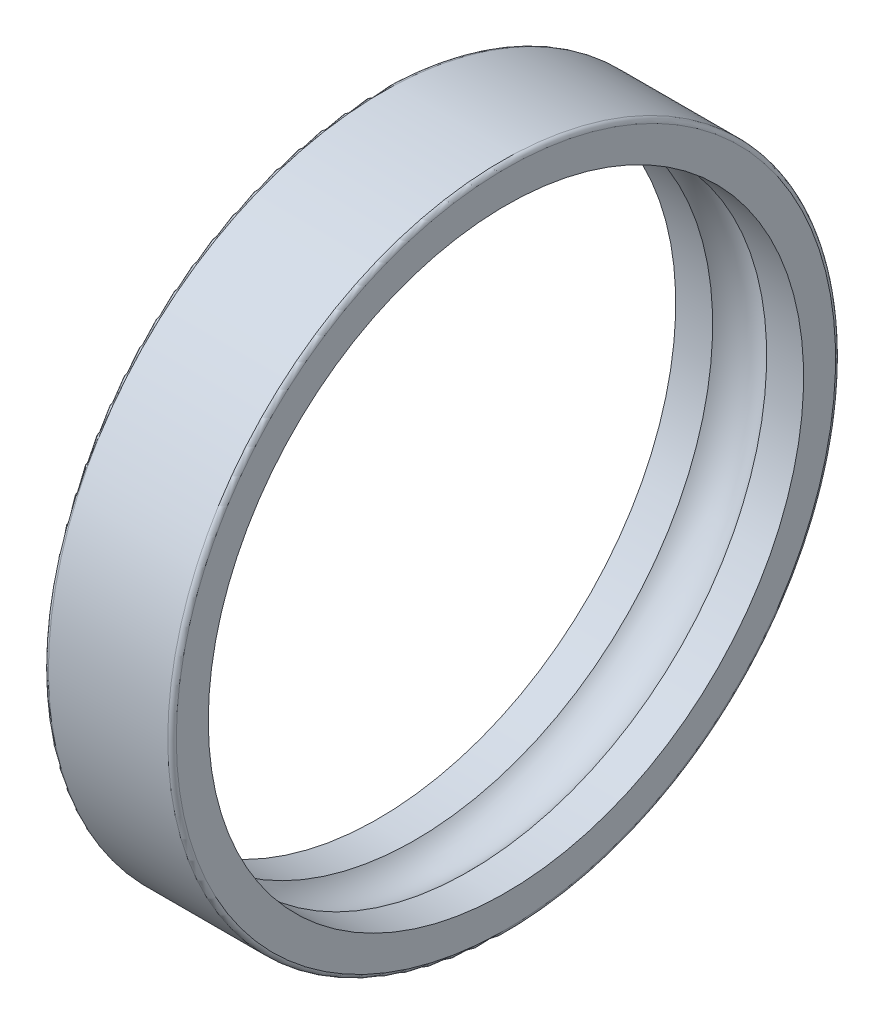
ISO-10303-21;
HEADER;
FILE_DESCRIPTION(('STEP AP214'),'2;1');
FILE_NAME('part.step','',(''),(''),'','','');
FILE_SCHEMA(('AUTOMOTIVE_DESIGN { 1 0 10303 214 1 1 1 1 }'));
ENDSEC;
DATA;
#1=APPLICATION_CONTEXT('core data for automotive mechanical design processes');
#2=APPLICATION_PROTOCOL_DEFINITION('international standard','automotive_design',2000,#1);
#3=PRODUCT_CONTEXT('',#1,'mechanical');
#4=PRODUCT('Part','Part','',(#3));
#5=PRODUCT_RELATED_PRODUCT_CATEGORY('part','',(#4));
#6=PRODUCT_DEFINITION_FORMATION('','',#4);
#7=PRODUCT_DEFINITION_CONTEXT('part definition',#1,'design');
#8=PRODUCT_DEFINITION('design','',#6,#7);
#9=PRODUCT_DEFINITION_SHAPE('','',#8);
#10=(LENGTH_UNIT() NAMED_UNIT(*) SI_UNIT(.MILLI.,.METRE.));
#11=(NAMED_UNIT(*) PLANE_ANGLE_UNIT() SI_UNIT($,.RADIAN.));
#12=(NAMED_UNIT(*) SI_UNIT($,.STERADIAN.) SOLID_ANGLE_UNIT());
#13=UNCERTAINTY_MEASURE_WITH_UNIT(LENGTH_MEASURE(1.E-05),#10,'distance_accuracy_value','');
#14=(GEOMETRIC_REPRESENTATION_CONTEXT(3) GLOBAL_UNCERTAINTY_ASSIGNED_CONTEXT((#13)) GLOBAL_UNIT_ASSIGNED_CONTEXT((#10,
#11,#12)) REPRESENTATION_CONTEXT('',''));
#15=CARTESIAN_POINT('',(0.,0.,0.));
#16=DIRECTION('',(0.,0.,1.));
#17=DIRECTION('',(1.,0.,0.));
#18=AXIS2_PLACEMENT_3D('',#15,#16,#17);
#19=CARTESIAN_POINT('',(0.299999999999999,0.,0.));
#20=DIRECTION('',(-1.,0.,0.));
#21=DIRECTION('',(0.,0.,1.));
#22=AXIS2_PLACEMENT_3D('',#19,#20,#21);
#23=TOROIDAL_SURFACE('',#22,23.2,0.300000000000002);
#24=CARTESIAN_POINT('',(0.,0.,0.));
#25=DIRECTION('',(-1.,0.,0.));
#26=DIRECTION('',(0.,0.,1.));
#27=AXIS2_PLACEMENT_3D('',#24,#25,#26);
#28=CIRCLE('',#27,23.2);
#29=CARTESIAN_POINT('',(0.,0.,23.2));
#30=VERTEX_POINT('',#29);
#31=EDGE_CURVE('E10',#30,#30,#28,.T.);
#32=ORIENTED_EDGE('',*,*,#31,.F.);
#33=EDGE_LOOP('',(#32));
#34=FACE_BOUND('',#33,.T.);
#35=CARTESIAN_POINT('',(0.299999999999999,0.,0.));
#36=DIRECTION('',(-1.,0.,0.));
#37=DIRECTION('',(0.,0.,1.));
#38=AXIS2_PLACEMENT_3D('',#35,#36,#37);
#39=CIRCLE('',#38,23.5);
#40=CARTESIAN_POINT('',(0.299999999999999,0.,23.5));
#41=VERTEX_POINT('',#40);
#42=EDGE_CURVE('E376',#41,#41,#39,.T.);
#43=ORIENTED_EDGE('',*,*,#42,.T.);
#44=EDGE_LOOP('',(#43));
#45=FACE_BOUND('',#44,.T.);
#46=ADVANCED_FACE('F348',(#34,#45),#23,.T.);
#47=CARTESIAN_POINT('',(0.,0.,-23.2));
#48=DIRECTION('',(1.,0.,0.));
#49=DIRECTION('',(0.,0.,-1.));
#50=AXIS2_PLACEMENT_3D('',#47,#48,#49);
#51=PLANE('',#50);
#52=CARTESIAN_POINT('',(0.,0.,0.));
#53=DIRECTION('',(-1.,0.,0.));
#54=DIRECTION('',(0.,0.,1.));
#55=AXIS2_PLACEMENT_3D('',#52,#53,#54);
#56=CIRCLE('',#55,20.95);
#57=CARTESIAN_POINT('',(0.,0.,20.95));
#58=VERTEX_POINT('',#57);
#59=EDGE_CURVE('E354',#58,#58,#56,.T.);
#60=ORIENTED_EDGE('',*,*,#59,.F.);
#61=EDGE_LOOP('',(#60));
#62=FACE_BOUND('',#61,.T.);
#63=ORIENTED_EDGE('',*,*,#31,.T.);
#64=EDGE_LOOP('',(#63));
#65=FACE_BOUND('',#64,.T.);
#66=ADVANCED_FACE('F413',(#62,#65),#51,.F.);
#67=CARTESIAN_POINT('',(0.,0.,0.));
#68=DIRECTION('',(-1.,0.,0.));
#69=DIRECTION('',(0.,0.,1.));
#70=AXIS2_PLACEMENT_3D('',#67,#68,#69);
#71=CYLINDRICAL_SURFACE('',#70,20.95);
#72=CARTESIAN_POINT('',(2.59934221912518,0.,0.));
#73=DIRECTION('',(-1.,0.,0.));
#74=DIRECTION('',(0.,0.,1.));
#75=AXIS2_PLACEMENT_3D('',#72,#73,#74);
#76=CIRCLE('',#75,20.95);
#77=CARTESIAN_POINT('',(2.59934221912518,0.,20.95));
#78=VERTEX_POINT('',#77);
#79=EDGE_CURVE('E358',#78,#78,#76,.T.);
#80=ORIENTED_EDGE('',*,*,#79,.F.);
#81=EDGE_LOOP('',(#80));
#82=FACE_BOUND('',#81,.T.);
#83=ORIENTED_EDGE('',*,*,#59,.T.);
#84=EDGE_LOOP('',(#83));
#85=FACE_BOUND('',#84,.T.);
#86=ADVANCED_FACE('F408',(#82,#85),#71,.F.);
#87=CARTESIAN_POINT('',(4.5,0.,0.));
#88=DIRECTION('',(-1.,0.,0.));
#89=DIRECTION('',(0.,0.,1.));
#90=AXIS2_PLACEMENT_3D('',#87,#88,#89);
#91=TOROIDAL_SURFACE('',#90,19.25,2.55);
#92=CARTESIAN_POINT('',(6.40065778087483,0.,0.));
#93=DIRECTION('',(-1.,0.,0.));
#94=DIRECTION('',(0.,0.,1.));
#95=AXIS2_PLACEMENT_3D('',#92,#93,#94);
#96=CIRCLE('',#95,20.95);
#97=CARTESIAN_POINT('',(6.40065778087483,0.,20.95));
#98=VERTEX_POINT('',#97);
#99=EDGE_CURVE('E362',#98,#98,#96,.T.);
#100=ORIENTED_EDGE('',*,*,#99,.F.);
#101=EDGE_LOOP('',(#100));
#102=FACE_BOUND('',#101,.T.);
#103=ORIENTED_EDGE('',*,*,#79,.T.);
#104=EDGE_LOOP('',(#103));
#105=FACE_BOUND('',#104,.T.);
#106=ADVANCED_FACE('F402',(#102,#105),#91,.F.);
#107=CARTESIAN_POINT('',(0.,0.,0.));
#108=DIRECTION('',(-1.,0.,0.));
#109=DIRECTION('',(0.,0.,1.));
#110=AXIS2_PLACEMENT_3D('',#107,#108,#109);
#111=CYLINDRICAL_SURFACE('',#110,20.95);
#112=CARTESIAN_POINT('',(9.,0.,0.));
#113=DIRECTION('',(-1.,0.,0.));
#114=DIRECTION('',(0.,0.,1.));
#115=AXIS2_PLACEMENT_3D('',#112,#113,#114);
#116=CIRCLE('',#115,20.95);
#117=CARTESIAN_POINT('',(9.,0.,20.95));
#118=VERTEX_POINT('',#117);
#119=EDGE_CURVE('E367',#118,#118,#116,.T.);
#120=ORIENTED_EDGE('',*,*,#119,.F.);
#121=EDGE_LOOP('',(#120));
#122=FACE_BOUND('',#121,.T.);
#123=ORIENTED_EDGE('',*,*,#99,.T.);
#124=EDGE_LOOP('',(#123));
#125=FACE_BOUND('',#124,.T.);
#126=ADVANCED_FACE('F396',(#122,#125),#111,.F.);
#127=CARTESIAN_POINT('',(9.,0.,-23.2));
#128=DIRECTION('',(-1.,0.,0.));
#129=DIRECTION('',(0.,0.,1.));
#130=AXIS2_PLACEMENT_3D('',#127,#128,#129);
#131=PLANE('',#130);
#132=CARTESIAN_POINT('',(9.00000000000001,0.,0.));
#133=DIRECTION('',(-1.,0.,0.));
#134=DIRECTION('',(0.,0.,1.));
#135=AXIS2_PLACEMENT_3D('',#132,#133,#134);
#136=CIRCLE('',#135,23.2);
#137=CARTESIAN_POINT('',(9.00000000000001,0.,23.2));
#138=VERTEX_POINT('',#137);
#139=EDGE_CURVE('E370',#138,#138,#136,.T.);
#140=ORIENTED_EDGE('',*,*,#139,.F.);
#141=EDGE_LOOP('',(#140));
#142=FACE_BOUND('',#141,.T.);
#143=ORIENTED_EDGE('',*,*,#119,.T.);
#144=EDGE_LOOP('',(#143));
#145=FACE_BOUND('',#144,.T.);
#146=ADVANCED_FACE('F390',(#142,#145),#131,.F.);
#147=CARTESIAN_POINT('',(8.7,0.,0.));
#148=DIRECTION('',(-1.,0.,0.));
#149=DIRECTION('',(0.,0.,1.));
#150=AXIS2_PLACEMENT_3D('',#147,#148,#149);
#151=TOROIDAL_SURFACE('',#150,23.2,0.300000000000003);
#152=CARTESIAN_POINT('',(8.7,0.,0.));
#153=DIRECTION('',(-1.,0.,0.));
#154=DIRECTION('',(0.,0.,1.));
#155=AXIS2_PLACEMENT_3D('',#152,#153,#154);
#156=CIRCLE('',#155,23.5);
#157=CARTESIAN_POINT('',(8.7,0.,23.5));
#158=VERTEX_POINT('',#157);
#159=EDGE_CURVE('E373',#158,#158,#156,.T.);
#160=ORIENTED_EDGE('',*,*,#159,.F.);
#161=EDGE_LOOP('',(#160));
#162=FACE_BOUND('',#161,.T.);
#163=ORIENTED_EDGE('',*,*,#139,.T.);
#164=EDGE_LOOP('',(#163));
#165=FACE_BOUND('',#164,.T.);
#166=ADVANCED_FACE('F384',(#162,#165),#151,.T.);
#167=CARTESIAN_POINT('',(0.,0.,0.));
#168=DIRECTION('',(-1.,0.,0.));
#169=DIRECTION('',(0.,0.,1.));
#170=AXIS2_PLACEMENT_3D('',#167,#168,#169);
#171=CYLINDRICAL_SURFACE('',#170,23.5);
#172=ORIENTED_EDGE('',*,*,#42,.F.);
#173=EDGE_LOOP('',(#172));
#174=FACE_BOUND('',#173,.T.);
#175=ORIENTED_EDGE('',*,*,#159,.T.);
#176=EDGE_LOOP('',(#175));
#177=FACE_BOUND('',#176,.T.);
#178=ADVANCED_FACE('F381',(#174,#177),#171,.T.);
#179=CLOSED_SHELL('',(#46,#66,#86,#106,#126,#146,#166,#178));
#180=MANIFOLD_SOLID_BREP('B2',#179);
#181=ADVANCED_BREP_SHAPE_REPRESENTATION('',(#18,#180),#14);
#182=SHAPE_DEFINITION_REPRESENTATION(#9,#181);
ENDSEC;
END-ISO-10303-21;
